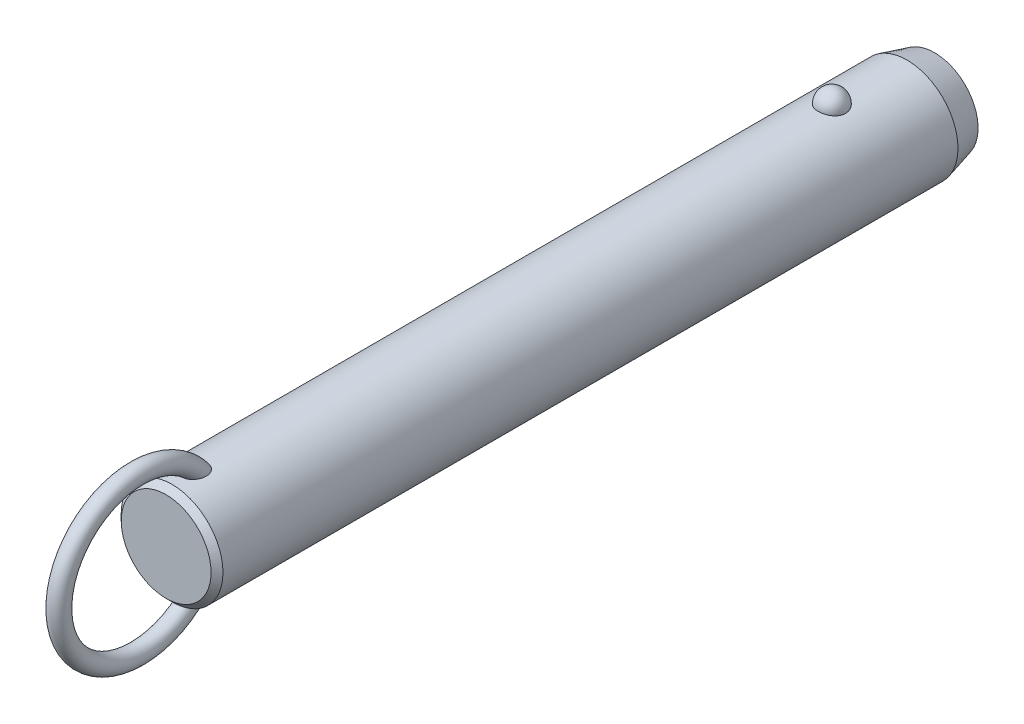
ISO-10303-21;
HEADER;
FILE_DESCRIPTION(('STEP AP214'),'2;1');
FILE_NAME('part.step','',(''),(''),'','','');
FILE_SCHEMA(('AUTOMOTIVE_DESIGN { 1 0 10303 214 1 1 1 1 }'));
ENDSEC;
DATA;
#1=APPLICATION_CONTEXT('core data for automotive mechanical design processes');
#2=APPLICATION_PROTOCOL_DEFINITION('international standard','automotive_design',2000,#1);
#3=PRODUCT_CONTEXT('',#1,'mechanical');
#4=PRODUCT('Part','Part','',(#3));
#5=PRODUCT_RELATED_PRODUCT_CATEGORY('part','',(#4));
#6=PRODUCT_DEFINITION_FORMATION('','',#4);
#7=PRODUCT_DEFINITION_CONTEXT('part definition',#1,'design');
#8=PRODUCT_DEFINITION('design','',#6,#7);
#9=PRODUCT_DEFINITION_SHAPE('','',#8);
#10=(LENGTH_UNIT() NAMED_UNIT(*) SI_UNIT(.MILLI.,.METRE.));
#11=(NAMED_UNIT(*) PLANE_ANGLE_UNIT() SI_UNIT($,.RADIAN.));
#12=(NAMED_UNIT(*) SI_UNIT($,.STERADIAN.) SOLID_ANGLE_UNIT());
#13=UNCERTAINTY_MEASURE_WITH_UNIT(LENGTH_MEASURE(1.E-05),#10,'distance_accuracy_value','');
#14=(GEOMETRIC_REPRESENTATION_CONTEXT(3) GLOBAL_UNCERTAINTY_ASSIGNED_CONTEXT((#13)) GLOBAL_UNIT_ASSIGNED_CONTEXT((#10,
#11,#12)) REPRESENTATION_CONTEXT('',''));
#15=CARTESIAN_POINT('',(0.,0.,0.));
#16=DIRECTION('',(0.,0.,1.));
#17=DIRECTION('',(1.,0.,0.));
#18=AXIS2_PLACEMENT_3D('',#15,#16,#17);
#19=CARTESIAN_POINT('',(0.,0.,129.5));
#20=DIRECTION('',(0.,0.,-1.));
#21=DIRECTION('',(-1.,0.,0.));
#22=AXIS2_PLACEMENT_3D('',#19,#20,#21);
#23=CYLINDRICAL_SURFACE('',#22,11.1);
#24=CARTESIAN_POINT('',(2.9724815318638,10.6945945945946,-3.));
#25=CARTESIAN_POINT('',(2.97247830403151,10.6945972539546,-2.83225059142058));
#26=CARTESIAN_POINT('',(2.95876598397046,10.6984356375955,-2.66445972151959));
#27=CARTESIAN_POINT('',(2.90424529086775,10.7133624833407,-2.33362381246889));
#28=CARTESIAN_POINT('',(2.8634252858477,10.7244540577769,-2.1705808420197));
#29=CARTESIAN_POINT('',(2.75573657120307,10.7526272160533,-1.85396767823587));
#30=CARTESIAN_POINT('',(2.68887937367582,10.7697061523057,-1.70039333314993));
#31=CARTESIAN_POINT('',(2.53079696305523,10.8079438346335,-1.40691598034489));
#32=CARTESIAN_POINT('',(2.43957264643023,10.8291024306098,-1.2670124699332));
#33=CARTESIAN_POINT('',(2.23458150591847,10.8732541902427,-1.00409565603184));
#34=CARTESIAN_POINT('',(2.12071295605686,10.8962553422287,-0.881162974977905));
#35=CARTESIAN_POINT('',(1.87365402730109,10.9414421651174,-0.656352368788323));
#36=CARTESIAN_POINT('',(1.74046358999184,10.9636278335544,-0.554474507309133));
#37=CARTESIAN_POINT('',(1.45872188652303,11.0046495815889,-0.374872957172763));
#38=CARTESIAN_POINT('',(1.31021276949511,11.0234944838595,-0.297085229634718));
#39=CARTESIAN_POINT('',(1.00170030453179,11.0557957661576,-0.167529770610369));
#40=CARTESIAN_POINT('',(0.841698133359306,11.0692526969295,-0.115759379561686));
#41=CARTESIAN_POINT('',(0.517607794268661,11.0890932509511,-0.0403925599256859));
#42=CARTESIAN_POINT('',(0.353633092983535,11.0955916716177,-0.0163383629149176));
#43=CARTESIAN_POINT('',(0.0238420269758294,11.1011989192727,0.0044517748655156));
#44=CARTESIAN_POINT('',(-0.141974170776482,11.1003084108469,0.00119017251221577));
#45=CARTESIAN_POINT('',(-0.468405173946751,11.0912990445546,-0.0323233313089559));
#46=CARTESIAN_POINT('',(-0.629059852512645,11.0832767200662,-0.0622147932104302));
#47=CARTESIAN_POINT('',(-0.942937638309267,11.0609962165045,-0.147645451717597));
#48=CARTESIAN_POINT('',(-1.09616062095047,11.0467379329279,-0.203185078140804));
#49=CARTESIAN_POINT('',(-1.39181061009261,11.0134071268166,-0.3387529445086));
#50=CARTESIAN_POINT('',(-1.53417383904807,10.9943086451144,-0.418913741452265));
#51=CARTESIAN_POINT('',(-1.80342160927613,10.9533667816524,-0.60144882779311));
#52=CARTESIAN_POINT('',(-1.9303046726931,10.9315231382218,-0.703825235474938));
#53=CARTESIAN_POINT('',(-2.16747598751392,10.887005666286,-0.930091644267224));
#54=CARTESIAN_POINT('',(-2.27742774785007,10.8643239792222,-1.05433291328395));
#55=CARTESIAN_POINT('',(-2.47517316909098,10.8209886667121,-1.31966633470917));
#56=CARTESIAN_POINT('',(-2.56296538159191,10.8003351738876,-1.46075958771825));
#57=CARTESIAN_POINT('',(-2.71500300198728,10.7631304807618,-1.75753646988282));
#58=CARTESIAN_POINT('',(-2.77898901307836,10.7466250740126,-1.91335887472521));
#59=CARTESIAN_POINT('',(-2.88046189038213,10.7198747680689,-2.2339152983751));
#60=CARTESIAN_POINT('',(-2.91794947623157,10.709629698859,-2.39864907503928));
#61=CARTESIAN_POINT('',(-2.96537819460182,10.6965949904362,-2.73165170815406));
#62=CARTESIAN_POINT('',(-2.97542891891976,10.693775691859,-2.89990378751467));
#63=CARTESIAN_POINT('',(-2.96804271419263,10.6958279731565,-3.235752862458));
#64=CARTESIAN_POINT('',(-2.95060646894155,10.7006993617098,-3.40334987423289));
#65=CARTESIAN_POINT('',(-2.88883358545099,10.71753912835,-3.73233906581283));
#66=CARTESIAN_POINT('',(-2.84462026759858,10.7294749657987,-3.89375610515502));
#67=CARTESIAN_POINT('',(-2.73050447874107,10.7590797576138,-4.20667949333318));
#68=CARTESIAN_POINT('',(-2.66060103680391,10.7767489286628,-4.35818546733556));
#69=CARTESIAN_POINT('',(-2.49642559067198,10.8159599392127,-4.6478542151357));
#70=CARTESIAN_POINT('',(-2.40203047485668,10.8375211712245,-4.78594458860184));
#71=CARTESIAN_POINT('',(-2.19143488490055,10.8820570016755,-5.0441038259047));
#72=CARTESIAN_POINT('',(-2.07523364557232,10.9050316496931,-5.16417205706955));
#73=CARTESIAN_POINT('',(-1.82361254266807,10.9499219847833,-5.38334833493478));
#74=CARTESIAN_POINT('',(-1.68812945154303,10.9718338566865,-5.48238464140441));
#75=CARTESIAN_POINT('',(-1.40191298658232,11.0120611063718,-5.65618873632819));
#76=CARTESIAN_POINT('',(-1.25118062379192,11.0303767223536,-5.73095813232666));
#77=CARTESIAN_POINT('',(-0.940570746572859,11.0611653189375,-5.85334725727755));
#78=CARTESIAN_POINT('',(-0.780821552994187,11.0737044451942,-5.90127578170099));
#79=CARTESIAN_POINT('',(-0.455204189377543,11.0918598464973,-5.96992976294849));
#80=CARTESIAN_POINT('',(-0.289336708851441,11.0974768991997,-5.99065827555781));
#81=CARTESIAN_POINT('',(0.0406846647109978,11.1011307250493,-6.00418773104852));
#82=CARTESIAN_POINT('',(0.204817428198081,11.099299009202,-5.99747318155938));
#83=CARTESIAN_POINT('',(0.5295530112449,11.088551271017,-5.9574031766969));
#84=CARTESIAN_POINT('',(0.69015594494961,11.0796354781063,-5.92404858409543));
#85=CARTESIAN_POINT('',(1.0027760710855,11.0557204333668,-5.83180084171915));
#86=CARTESIAN_POINT('',(1.15482001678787,11.0407414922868,-5.77299291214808));
#87=CARTESIAN_POINT('',(1.44678373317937,11.0062913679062,-5.63147366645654));
#88=CARTESIAN_POINT('',(1.58670279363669,10.9868199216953,-5.54876095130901));
#89=CARTESIAN_POINT('',(1.8527023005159,10.9451315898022,-5.36027644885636));
#90=CARTESIAN_POINT('',(1.97855158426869,10.9228788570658,-5.25418644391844));
#91=CARTESIAN_POINT('',(2.21080872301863,10.8782509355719,-5.02251354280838));
#92=CARTESIAN_POINT('',(2.31721312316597,10.8558757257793,-4.89692718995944));
#93=CARTESIAN_POINT('',(2.5094551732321,10.8130715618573,-4.62745408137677));
#94=CARTESIAN_POINT('',(2.59493284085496,10.7926798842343,-4.48330448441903));
#95=CARTESIAN_POINT('',(2.740862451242,10.7565495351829,-4.18236358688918));
#96=CARTESIAN_POINT('',(2.80132490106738,10.7408089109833,-4.02557762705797));
#97=CARTESIAN_POINT('',(2.88959070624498,10.7173718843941,-3.72475308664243));
#98=CARTESIAN_POINT('',(2.92062102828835,10.7088950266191,-3.58171216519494));
#99=CARTESIAN_POINT('',(2.96206765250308,10.6975052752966,-3.29245795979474));
#100=CARTESIAN_POINT('',(2.97248434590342,10.6945922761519,-3.14624473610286));
#101=CARTESIAN_POINT('',(2.9724815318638,10.6945945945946,-3.));
#102=B_SPLINE_CURVE_WITH_KNOTS('',3,(#24,#25,#26,#27,#28,#29,#30,#31,#32,#33,#34,#35,#36,#37,
#38,#39,#40,#41,#42,#43,#44,#45,#46,#47,#48,#49,#50,#51,#52,#53,#54,#55,#56,#57,#58,#59,#60,#61,
#62,#63,#64,#65,#66,#67,#68,#69,#70,#71,#72,#73,#74,#75,#76,#77,#78,#79,#80,#81,#82,#83,#84,#85,
#86,#87,#88,#89,#90,#91,#92,#93,#94,#95,#96,#97,#98,#99,#100,#101),.UNSPECIFIED.,.T.,.F.,(4,2,2,
2,2,2,2,2,2,2,2,2,2,2,2,2,2,2,2,2,2,2,2,2,2,2,2,2,2,2,2,2,2,2,2,2,2,2,4),(0.,0.502722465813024,
1.00566079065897,1.5083769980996,2.01107471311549,2.51608392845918,3.02109467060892,
3.52475118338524,4.02835620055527,4.523518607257,5.0186364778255,5.50715297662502,
5.9956776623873,6.48688002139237,6.97812923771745,7.47814366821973,7.9781907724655,
8.48353712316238,8.9888697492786,9.49218093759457,9.99547960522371,10.4964777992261,
10.997494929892,11.5010810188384,12.0046847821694,12.5099796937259,13.0152411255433,
13.5145635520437,14.0138298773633,14.5043200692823,14.9947943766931,15.4836390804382,
15.9725123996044,16.4685040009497,16.9645836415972,17.4686765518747,17.972557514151,
18.410841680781,18.849117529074),.UNSPECIFIED.);
#103=CARTESIAN_POINT('',(2.9724815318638,10.6945945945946,-3.));
#104=VERTEX_POINT('',#103);
#105=EDGE_CURVE('E41',#104,#104,#102,.T.);
#106=ORIENTED_EDGE('',*,*,#105,.T.);
#107=EDGE_LOOP('',(#106));
#108=FACE_BOUND('',#107,.T.);
#109=CARTESIAN_POINT('',(0.,0.,140.9));
#110=DIRECTION('',(0.,0.,1.));
#111=DIRECTION('',(1.,0.,0.));
#112=AXIS2_PLACEMENT_3D('',#109,#110,#111);
#113=CIRCLE('',#112,11.1);
#114=CARTESIAN_POINT('',(11.1,0.,140.9));
#115=VERTEX_POINT('',#114);
#116=EDGE_CURVE('E10',#115,#115,#113,.F.);
#117=ORIENTED_EDGE('',*,*,#116,.T.);
#118=EDGE_LOOP('',(#117));
#119=FACE_BOUND('',#118,.T.);
#120=CARTESIAN_POINT('',(-0.564520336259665,-11.0856356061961,133.157815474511));
#121=CARTESIAN_POINT('',(-0.667202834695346,-11.0804062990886,133.191283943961));
#122=CARTESIAN_POINT('',(-0.766875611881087,-11.0738877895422,133.233835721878));
#123=CARTESIAN_POINT('',(-0.95728412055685,-11.0590576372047,133.335419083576));
#124=CARTESIAN_POINT('',(-1.04801616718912,-11.0507452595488,133.39445742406));
#125=CARTESIAN_POINT('',(-1.21800952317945,-11.0333016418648,133.526529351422));
#126=CARTESIAN_POINT('',(-1.2973080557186,-11.0241732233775,133.599515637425));
#127=CARTESIAN_POINT('',(-1.44337665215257,-11.0060026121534,133.757037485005));
#128=CARTESIAN_POINT('',(-1.51014622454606,-10.9969604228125,133.841573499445));
#129=CARTESIAN_POINT('',(-1.63454620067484,-10.9791841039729,134.025521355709));
#130=CARTESIAN_POINT('',(-1.69127003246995,-10.9705107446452,134.125549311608));
#131=CARTESIAN_POINT('',(-1.7898078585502,-10.9548648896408,134.332790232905));
#132=CARTESIAN_POINT('',(-1.83161214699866,-10.9478935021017,134.440007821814));
#133=CARTESIAN_POINT('',(-1.91557028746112,-10.9335803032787,134.705408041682));
#134=CARTESIAN_POINT('',(-1.95040620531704,-10.9273269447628,134.865980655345));
#135=CARTESIAN_POINT('',(-1.99388326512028,-10.9194709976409,135.190697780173));
#136=CARTESIAN_POINT('',(-2.00248051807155,-10.9178762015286,135.354847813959));
#137=CARTESIAN_POINT('',(-1.99551615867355,-10.9191578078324,135.724650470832));
#138=CARTESIAN_POINT('',(-1.9732206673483,-10.9232807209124,135.930191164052));
#139=CARTESIAN_POINT('',(-1.9152976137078,-10.9335244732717,136.233595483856));
#140=CARTESIAN_POINT('',(-1.89184575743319,-10.9376266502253,136.334088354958));
#141=CARTESIAN_POINT('',(-1.83700674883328,-10.9469720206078,136.532855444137));
#142=CARTESIAN_POINT('',(-1.80562070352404,-10.9522150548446,136.631129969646));
#143=CARTESIAN_POINT('',(-1.73463055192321,-10.9636837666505,136.825914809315));
#144=CARTESIAN_POINT('',(-1.69493416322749,-10.9699202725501,136.922390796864));
#145=CARTESIAN_POINT('',(-1.60745141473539,-10.9830806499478,137.111626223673));
#146=CARTESIAN_POINT('',(-1.55966150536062,-10.9900048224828,137.204384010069));
#147=CARTESIAN_POINT('',(-1.45591812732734,-11.0042280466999,137.384690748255));
#148=CARTESIAN_POINT('',(-1.40000013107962,-11.0115253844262,137.472260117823));
#149=CARTESIAN_POINT('',(-1.27937470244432,-11.0261911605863,137.641029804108));
#150=CARTESIAN_POINT('',(-1.21467835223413,-11.0335594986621,137.72223795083));
#151=CARTESIAN_POINT('',(-1.08218150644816,-11.0473027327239,137.869001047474));
#152=CARTESIAN_POINT('',(-1.01522633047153,-11.0537063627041,137.935309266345));
#153=CARTESIAN_POINT('',(-0.872952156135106,-11.065850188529,138.058378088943));
#154=CARTESIAN_POINT('',(-0.797642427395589,-11.0715911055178,138.115149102));
#155=CARTESIAN_POINT('',(-0.651396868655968,-11.081071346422,138.207515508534));
#156=CARTESIAN_POINT('',(-0.581712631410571,-11.0849841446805,138.245049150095));
#157=CARTESIAN_POINT('',(-0.43706608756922,-11.0916271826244,138.308259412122));
#158=CARTESIAN_POINT('',(-0.362109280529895,-11.0943586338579,138.333948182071));
#159=CARTESIAN_POINT('',(-0.207828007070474,-11.0983242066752,138.371117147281));
#160=CARTESIAN_POINT('',(-0.12846771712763,-11.0995432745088,138.382454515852));
#161=CARTESIAN_POINT('',(0.0309101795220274,-11.1002423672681,138.388965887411));
#162=CARTESIAN_POINT('',(0.110927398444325,-11.0997233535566,138.384148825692));
#163=CARTESIAN_POINT('',(0.25640659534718,-11.097240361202,138.360959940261));
#164=CARTESIAN_POINT('',(0.322235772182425,-11.0955074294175,138.344754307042));
#165=CARTESIAN_POINT('',(0.450635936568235,-11.0910350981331,138.302600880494));
#166=CARTESIAN_POINT('',(0.513205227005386,-11.0882951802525,138.276648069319));
#167=CARTESIAN_POINT('',(0.662626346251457,-11.0805620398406,138.202607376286));
#168=CARTESIAN_POINT('',(0.747127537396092,-11.0751144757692,138.149845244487));
#169=CARTESIAN_POINT('',(0.906756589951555,-11.0631932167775,138.031720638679));
#170=CARTESIAN_POINT('',(0.981859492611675,-11.0567168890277,137.966325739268));
#171=CARTESIAN_POINT('',(1.10712207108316,-11.0447856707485,137.84226337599));
#172=CARTESIAN_POINT('',(1.15909566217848,-11.0394280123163,137.785383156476));
#173=CARTESIAN_POINT('',(1.25791923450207,-11.0286040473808,137.667327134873));
#174=CARTESIAN_POINT('',(1.30476642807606,-11.0231376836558,137.606149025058));
#175=CARTESIAN_POINT('',(1.43818612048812,-11.0068027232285,137.417305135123));
#176=CARTESIAN_POINT('',(1.51751767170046,-10.9960104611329,137.284453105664));
#177=CARTESIAN_POINT('',(1.63597546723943,-10.9788847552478,137.053137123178));
#178=CARTESIAN_POINT('',(1.67988876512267,-10.9722190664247,136.957053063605));
#179=CARTESIAN_POINT('',(1.75953241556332,-10.9597298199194,136.761431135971));
#180=CARTESIAN_POINT('',(1.7952596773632,-10.9539065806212,136.661891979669));
#181=CARTESIAN_POINT('',(1.85844731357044,-10.9433632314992,136.46021118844));
#182=CARTESIAN_POINT('',(1.88591073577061,-10.9386427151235,136.35807052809));
#183=CARTESIAN_POINT('',(1.93234324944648,-10.9305350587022,136.151819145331));
#184=CARTESIAN_POINT('',(1.95131065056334,-10.9271481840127,136.047708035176));
#185=CARTESIAN_POINT('',(1.9904020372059,-10.9201183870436,135.765458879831));
#186=CARTESIAN_POINT('',(2.00221217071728,-10.9179256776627,135.586037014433));
#187=CARTESIAN_POINT('',(1.99711676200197,-10.9188636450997,135.227713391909));
#188=CARTESIAN_POINT('',(1.98026150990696,-10.9219849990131,135.048811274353));
#189=CARTESIAN_POINT('',(1.92151657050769,-10.9324473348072,134.73645144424));
#190=CARTESIAN_POINT('',(1.88605081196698,-10.9386915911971,134.601759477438));
#191=CARTESIAN_POINT('',(1.79393020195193,-10.9541780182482,134.339966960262));
#192=CARTESIAN_POINT('',(1.73729868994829,-10.9634168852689,134.212858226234));
#193=CARTESIAN_POINT('',(1.61237037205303,-10.9824218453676,133.989418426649));
#194=CARTESIAN_POINT('',(1.54715374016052,-10.9918945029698,133.891345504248));
#195=CARTESIAN_POINT('',(1.40127026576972,-11.0114415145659,133.707434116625));
#196=CARTESIAN_POINT('',(1.32060742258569,-11.0215157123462,133.621592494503));
#197=CARTESIAN_POINT('',(1.1447478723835,-11.041168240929,133.465163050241));
#198=CARTESIAN_POINT('',(1.04947805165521,-11.0507437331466,133.394656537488));
#199=CARTESIAN_POINT('',(0.847278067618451,-11.0680789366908,133.272640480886));
#200=CARTESIAN_POINT('',(0.74035174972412,-11.0758392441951,133.221124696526));
#201=CARTESIAN_POINT('',(0.529289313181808,-11.0878275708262,133.143485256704));
#202=CARTESIAN_POINT('',(0.425895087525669,-11.0923259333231,133.115377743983));
#203=CARTESIAN_POINT('',(0.215723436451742,-11.0984001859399,133.077703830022));
#204=CARTESIAN_POINT('',(0.108947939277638,-11.0999777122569,133.068127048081));
#205=CARTESIAN_POINT('',(-0.0938962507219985,-11.1000196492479,133.067877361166));
#206=CARTESIAN_POINT('',(-0.189967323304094,-11.0987797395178,133.075408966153));
#207=CARTESIAN_POINT('',(-0.379657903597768,-11.0939111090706,133.105507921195));
#208=CARTESIAN_POINT('',(-0.47327735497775,-11.0902823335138,133.128075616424));
#209=CARTESIAN_POINT('',(-0.564520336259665,-11.0856356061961,133.157815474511));
#210=B_SPLINE_CURVE_WITH_KNOTS('',3,(#120,#121,#122,#123,#124,#125,#126,#127,#128,#129,#130,
#131,#132,#133,#134,#135,#136,#137,#138,#139,#140,#141,#142,#143,#144,#145,#146,#147,#148,#149,
#150,#151,#152,#153,#154,#155,#156,#157,#158,#159,#160,#161,#162,#163,#164,#165,#166,#167,#168,
#169,#170,#171,#172,#173,#174,#175,#176,#177,#178,#179,#180,#181,#182,#183,#184,#185,#186,#187,
#188,#189,#190,#191,#192,#193,#194,#195,#196,#197,#198,#199,#200,#201,#202,#203,#204,#205,#206,
#207,#208,#209),.UNSPECIFIED.,.T.,.F.,(4,2,2,2,2,2,2,2,2,2,2,2,2,2,2,2,2,2,2,2,2,2,2,2,2,2,2,2,
2,2,2,2,2,2,2,2,2,2,2,2,2,2,2,2,4),(0.,0.323999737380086,0.64813245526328,0.971184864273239,
1.29424994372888,1.63886237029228,1.98369857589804,2.47426059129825,2.96564271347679,
3.58257396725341,3.89215258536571,4.20168803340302,4.51486273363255,4.82817514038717,
5.14015911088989,5.45175282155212,5.73442856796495,6.01679375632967,6.2536458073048,
6.49025437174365,6.72919963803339,6.96801276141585,7.17061258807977,7.37331685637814,
7.67094989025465,7.96935728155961,8.20075067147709,8.4322692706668,8.89581623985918,
9.21306533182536,9.53043400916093,9.84768549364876,10.1650000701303,10.7022930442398,
11.2386443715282,11.655339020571,12.071575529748,12.4245637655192,12.7774607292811,
13.1321855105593,13.4867936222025,13.8068771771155,14.1267813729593,14.4146787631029,
14.7025827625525),.UNSPECIFIED.);
#211=CARTESIAN_POINT('',(-0.564520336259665,-11.0856356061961,133.157815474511));
#212=VERTEX_POINT('',#211);
#213=EDGE_CURVE('E59',#212,#212,#210,.T.);
#214=ORIENTED_EDGE('',*,*,#213,.T.);
#215=EDGE_LOOP('',(#214));
#216=FACE_BOUND('',#215,.T.);
#217=CARTESIAN_POINT('',(-0.564520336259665,11.0856356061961,133.157815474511));
#218=CARTESIAN_POINT('',(-0.468542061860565,11.0905203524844,133.126545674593));
#219=CARTESIAN_POINT('',(-0.369793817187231,11.0942886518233,133.103157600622));
#220=CARTESIAN_POINT('',(-0.169555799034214,11.0991586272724,133.073085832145));
#221=CARTESIAN_POINT('',(-0.0680604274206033,11.1002543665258,133.06643932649));
#222=CARTESIAN_POINT('',(0.134549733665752,11.099646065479,133.070157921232));
#223=CARTESIAN_POINT('',(0.235664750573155,11.0979441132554,133.08051033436));
#224=CARTESIAN_POINT('',(0.434632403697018,11.0919342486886,133.117831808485));
#225=CARTESIAN_POINT('',(0.532486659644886,11.0876276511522,133.144792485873));
#226=CARTESIAN_POINT('',(0.722445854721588,11.0768742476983,133.2144096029));
#227=CARTESIAN_POINT('',(0.814543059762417,11.0704246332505,133.257086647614));
#228=CARTESIAN_POINT('',(0.990565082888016,11.0560659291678,133.356648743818));
#229=CARTESIAN_POINT('',(1.07448844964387,11.048156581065,133.413536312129));
#230=CARTESIAN_POINT('',(1.23562672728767,11.0313221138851,133.542210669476));
#231=CARTESIAN_POINT('',(1.3124268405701,11.0223686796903,133.614511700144));
#232=CARTESIAN_POINT('',(1.45398030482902,11.0045918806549,133.770042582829));
#233=CARTESIAN_POINT('',(1.51873073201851,10.9957685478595,133.853275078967));
#234=CARTESIAN_POINT('',(1.64107232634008,10.9782087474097,134.036384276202));
#235=CARTESIAN_POINT('',(1.6974317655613,10.9695572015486,134.137089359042));
#236=CARTESIAN_POINT('',(1.79515063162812,10.9539887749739,134.345626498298));
#237=CARTESIAN_POINT('',(1.83649966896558,10.9470730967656,134.45346343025));
#238=CARTESIAN_POINT('',(1.91931148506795,10.9329211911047,134.720399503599));
#239=CARTESIAN_POINT('',(1.95340104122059,10.9267904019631,134.881861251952));
#240=CARTESIAN_POINT('',(1.99526195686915,10.9192174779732,135.20821631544));
#241=CARTESIAN_POINT('',(2.00298989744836,10.9177830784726,135.37311484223));
#242=CARTESIAN_POINT('',(1.99396251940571,10.9194420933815,135.744100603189));
#243=CARTESIAN_POINT('',(1.97050829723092,10.923774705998,135.95003871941));
#244=CARTESIAN_POINT('',(1.91079643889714,10.9343131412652,136.253901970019));
#245=CARTESIAN_POINT('',(1.88673702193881,10.9385106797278,136.354529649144));
#246=CARTESIAN_POINT('',(1.83065508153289,10.9480376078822,136.553510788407));
#247=CARTESIAN_POINT('',(1.79863369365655,10.9533668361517,136.651864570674));
#248=CARTESIAN_POINT('',(1.72633365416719,10.9649954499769,136.846720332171));
#249=CARTESIAN_POINT('',(1.68596409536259,10.9713053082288,136.94318790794));
#250=CARTESIAN_POINT('',(1.59707998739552,10.9845964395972,137.132323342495));
#251=CARTESIAN_POINT('',(1.54856169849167,10.9915780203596,137.224989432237));
#252=CARTESIAN_POINT('',(1.44330168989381,11.0058935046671,137.404975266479));
#253=CARTESIAN_POINT('',(1.3865974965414,11.0132257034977,137.492316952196));
#254=CARTESIAN_POINT('',(1.26431158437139,11.0279330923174,137.660456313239));
#255=CARTESIAN_POINT('',(1.19874160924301,11.0353082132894,137.741262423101));
#256=CARTESIAN_POINT('',(1.06542088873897,11.048931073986,137.885985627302));
#257=CARTESIAN_POINT('',(0.998640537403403,11.0552153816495,137.950784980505));
#258=CARTESIAN_POINT('',(0.856896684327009,11.0671032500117,138.070846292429));
#259=CARTESIAN_POINT('',(0.781942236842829,11.0727075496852,138.126118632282));
#260=CARTESIAN_POINT('',(0.636276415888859,11.081949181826,138.215972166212));
#261=CARTESIAN_POINT('',(0.566755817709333,11.0857572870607,138.252441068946));
#262=CARTESIAN_POINT('',(0.422602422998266,11.0921860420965,138.313533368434));
#263=CARTESIAN_POINT('',(0.347974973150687,11.0948079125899,138.338168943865));
#264=CARTESIAN_POINT('',(0.194593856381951,11.0985608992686,138.373323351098));
#265=CARTESIAN_POINT('',(0.115807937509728,11.0996777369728,138.383706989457));
#266=CARTESIAN_POINT('',(-0.042249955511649,11.1002003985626,138.388574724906));
#267=CARTESIAN_POINT('',(-0.121521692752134,11.09960699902,138.383066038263));
#268=CARTESIAN_POINT('',(-0.26604624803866,11.0970123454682,138.358827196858));
#269=CARTESIAN_POINT('',(-0.331661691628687,11.0952283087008,138.342135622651));
#270=CARTESIAN_POINT('',(-0.459588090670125,11.0906663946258,138.299111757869));
#271=CARTESIAN_POINT('',(-0.521897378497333,11.0878880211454,138.272774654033));
#272=CARTESIAN_POINT('',(-0.671446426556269,11.0800342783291,138.197513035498));
#273=CARTESIAN_POINT('',(-0.756250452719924,11.0744969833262,138.143818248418));
#274=CARTESIAN_POINT('',(-0.916349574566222,11.0624045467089,138.023802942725));
#275=CARTESIAN_POINT('',(-0.991618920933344,11.0558467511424,137.957449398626));
#276=CARTESIAN_POINT('',(-1.11713140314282,11.0437783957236,137.831633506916));
#277=CARTESIAN_POINT('',(-1.16920539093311,11.0383619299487,137.773952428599));
#278=CARTESIAN_POINT('',(-1.2681747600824,11.02743010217,137.654280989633));
#279=CARTESIAN_POINT('',(-1.31506731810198,11.0219146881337,137.592288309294));
#280=CARTESIAN_POINT('',(-1.40399813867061,11.0109399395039,137.464784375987));
#281=CARTESIAN_POINT('',(-1.44602864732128,11.0054807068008,137.399267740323));
#282=CARTESIAN_POINT('',(-1.52538779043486,10.9947621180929,137.265422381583));
#283=CARTESIAN_POINT('',(-1.56271516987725,10.9895028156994,137.197092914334));
#284=CARTESIAN_POINT('',(-1.64537943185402,10.9774790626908,137.033210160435));
#285=CARTESIAN_POINT('',(-1.68879497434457,10.9708503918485,136.9366735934));
#286=CARTESIAN_POINT('',(-1.76740738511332,10.9584602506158,136.740236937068));
#287=CARTESIAN_POINT('',(-1.80260120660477,10.95269910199,136.64033561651));
#288=CARTESIAN_POINT('',(-1.86468657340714,10.9423003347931,136.437966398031));
#289=CARTESIAN_POINT('',(-1.8915816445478,10.9376622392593,136.335499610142));
#290=CARTESIAN_POINT('',(-1.93682458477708,10.9297405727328,136.128642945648));
#291=CARTESIAN_POINT('',(-1.95517082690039,10.9264572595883,136.024252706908));
#292=CARTESIAN_POINT('',(-1.99232562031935,10.9197647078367,135.74262876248));
#293=CARTESIAN_POINT('',(-2.00294603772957,10.9177914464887,135.564185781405));
#294=CARTESIAN_POINT('',(-1.99566675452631,10.9191290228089,135.207996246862));
#295=CARTESIAN_POINT('',(-1.97781651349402,10.9224306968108,135.03024902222));
#296=CARTESIAN_POINT('',(-1.91747214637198,10.9331592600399,134.719792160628));
#297=CARTESIAN_POINT('',(-1.88131022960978,10.9395108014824,134.585825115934));
#298=CARTESIAN_POINT('',(-1.78790380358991,10.9551659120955,134.32559757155));
#299=CARTESIAN_POINT('',(-1.73068309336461,10.9644661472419,134.199328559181));
#300=CARTESIAN_POINT('',(-1.60475573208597,10.9835398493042,133.97741565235));
#301=CARTESIAN_POINT('',(-1.53908879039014,10.9930297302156,133.880026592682));
#302=CARTESIAN_POINT('',(-1.39238608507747,11.0125708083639,133.697525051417));
#303=CARTESIAN_POINT('',(-1.31135150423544,11.0226219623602,133.612411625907));
#304=CARTESIAN_POINT('',(-1.14382035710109,11.0411991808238,133.46529943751));
#305=CARTESIAN_POINT('',(-1.0585850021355,11.0497792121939,133.40186930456));
#306=CARTESIAN_POINT('',(-0.878723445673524,11.0655285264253,133.290250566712));
#307=CARTESIAN_POINT('',(-0.784123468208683,11.0727015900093,133.242020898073));
#308=CARTESIAN_POINT('',(-0.646163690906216,11.0812501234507,133.186023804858));
#309=CARTESIAN_POINT('',(-0.605595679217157,11.0835451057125,133.171197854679));
#310=CARTESIAN_POINT('',(-0.564520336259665,11.0856356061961,133.157815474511));
#311=B_SPLINE_CURVE_WITH_KNOTS('',3,(#217,#218,#219,#220,#221,#222,#223,#224,#225,#226,#227,
#228,#229,#230,#231,#232,#233,#234,#235,#236,#237,#238,#239,#240,#241,#242,#243,#244,#245,#246,
#247,#248,#249,#250,#251,#252,#253,#254,#255,#256,#257,#258,#259,#260,#261,#262,#263,#264,#265,
#266,#267,#268,#269,#270,#271,#272,#273,#274,#275,#276,#277,#278,#279,#280,#281,#282,#283,#284,
#285,#286,#287,#288,#289,#290,#291,#292,#293,#294,#295,#296,#297,#298,#299,#300,#301,#302,#303,
#304,#305,#306,#307,#308,#309,#310),.UNSPECIFIED.,.T.,.F.,(4,2,2,2,2,2,2,2,2,2,2,2,2,2,2,2,2,2,
2,2,2,2,2,2,2,2,2,2,2,2,2,2,2,2,2,2,2,2,2,2,2,2,2,2,2,2,4),(0.,0.303061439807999,
0.606795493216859,0.910302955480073,1.21365733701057,1.51741085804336,1.82121821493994,
2.13745205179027,2.45376252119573,2.79958678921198,3.14564996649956,3.63832391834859,
4.13180893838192,4.75031912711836,5.06071926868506,5.37107516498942,5.6850077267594,
5.99908475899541,6.31176519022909,6.62403542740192,6.90315673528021,7.18197194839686,
7.41687778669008,7.65154134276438,7.88841587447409,8.12518286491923,8.32752842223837,
8.52997509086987,8.82986421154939,9.13054668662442,9.36393502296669,9.5974499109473,
9.83133221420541,10.0652767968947,10.383032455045,10.7009056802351,11.0186436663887,
11.3364420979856,11.8705925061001,12.4038159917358,12.8189662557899,13.2336487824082,
13.5857049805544,13.9377340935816,14.2561354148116,14.5736690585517,14.7033687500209),.UNSPECIFIED.);
#312=CARTESIAN_POINT('',(-0.564520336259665,11.0856356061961,133.157815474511));
#313=VERTEX_POINT('',#312);
#314=EDGE_CURVE('E67',#313,#313,#311,.T.);
#315=ORIENTED_EDGE('',*,*,#314,.T.);
#316=EDGE_LOOP('',(#315));
#317=FACE_BOUND('',#316,.T.);
#318=CARTESIAN_POINT('',(0.,0.,-19.3999999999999));
#319=DIRECTION('',(0.,0.,-1.));
#320=DIRECTION('',(-1.,0.,0.));
#321=AXIS2_PLACEMENT_3D('',#318,#319,#320);
#322=CIRCLE('',#321,11.1);
#323=CARTESIAN_POINT('',(-11.1,0.,-19.3999999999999));
#324=VERTEX_POINT('',#323);
#325=EDGE_CURVE('E56',#324,#324,#322,.F.);
#326=ORIENTED_EDGE('',*,*,#325,.T.);
#327=EDGE_LOOP('',(#326));
#328=FACE_BOUND('',#327,.T.);
#329=ADVANCED_FACE('F37',(#108,#119,#216,#317,#328),#23,.T.);
#330=CARTESIAN_POINT('',(0.,0.,-25.4));
#331=DIRECTION('',(0.,0.,-1.));
#332=DIRECTION('',(-1.,0.,0.));
#333=AXIS2_PLACEMENT_3D('',#330,#331,#332);
#334=PLANE('',#333);
#335=CARTESIAN_POINT('',(0.,0.,-25.4));
#336=DIRECTION('',(0.,0.,-1.));
#337=DIRECTION('',(-1.,0.,0.));
#338=AXIS2_PLACEMENT_3D('',#335,#336,#337);
#339=CIRCLE('',#338,9.49230484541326);
#340=CARTESIAN_POINT('',(-9.49230484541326,0.,-25.4));
#341=VERTEX_POINT('',#340);
#342=EDGE_CURVE('E66',#341,#341,#339,.T.);
#343=ORIENTED_EDGE('',*,*,#342,.T.);
#344=EDGE_LOOP('',(#343));
#345=FACE_BOUND('',#344,.T.);
#346=ADVANCED_FACE('F85',(#345),#334,.T.);
#347=CARTESIAN_POINT('',(0.,0.,-25.4));
#348=DIRECTION('',(0.,0.,1.));
#349=DIRECTION('',(1.,0.,0.));
#350=AXIS2_PLACEMENT_3D('',#347,#348,#349);
#351=CONICAL_SURFACE('',#350,9.49230484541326,0.261799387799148);
#352=ORIENTED_EDGE('',*,*,#325,.F.);
#353=EDGE_LOOP('',(#352));
#354=FACE_BOUND('',#353,.T.);
#355=ORIENTED_EDGE('',*,*,#342,.F.);
#356=EDGE_LOOP('',(#355));
#357=FACE_BOUND('',#356,.T.);
#358=ADVANCED_FACE('F83',(#354,#357),#351,.T.);
#359=CARTESIAN_POINT('',(0.,0.,142.2));
#360=DIRECTION('',(0.,0.,1.));
#361=DIRECTION('',(1.,0.,0.));
#362=AXIS2_PLACEMENT_3D('',#359,#360,#361);
#363=PLANE('',#362);
#364=CARTESIAN_POINT('',(0.,0.,142.2));
#365=DIRECTION('',(0.,0.,1.));
#366=DIRECTION('',(1.,0.,0.));
#367=AXIS2_PLACEMENT_3D('',#364,#365,#366);
#368=CIRCLE('',#367,9.80000000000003);
#369=CARTESIAN_POINT('',(9.80000000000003,0.,142.2));
#370=VERTEX_POINT('',#369);
#371=EDGE_CURVE('E50',#370,#370,#368,.T.);
#372=ORIENTED_EDGE('',*,*,#371,.T.);
#373=EDGE_LOOP('',(#372));
#374=FACE_BOUND('',#373,.T.);
#375=ADVANCED_FACE('F77',(#374),#363,.T.);
#376=CARTESIAN_POINT('',(0.,0.,148.55));
#377=DIRECTION('',(1.,0.,0.));
#378=DIRECTION('',(0.,0.,-1.));
#379=AXIS2_PLACEMENT_3D('',#376,#377,#378);
#380=TOROIDAL_SURFACE('',#379,17.05,2.);
#381=ORIENTED_EDGE('',*,*,#314,.F.);
#382=EDGE_LOOP('',(#381));
#383=FACE_BOUND('',#382,.T.);
#384=ORIENTED_EDGE('',*,*,#213,.F.);
#385=EDGE_LOOP('',(#384));
#386=FACE_BOUND('',#385,.T.);
#387=ADVANCED_FACE('F73',(#383,#386),#380,.T.);
#388=CARTESIAN_POINT('',(0.,0.,142.2));
#389=DIRECTION('',(0.,0.,-1.));
#390=DIRECTION('',(-1.,0.,0.));
#391=AXIS2_PLACEMENT_3D('',#388,#389,#390);
#392=CONICAL_SURFACE('',#391,9.80000000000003,0.785398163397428);
#393=ORIENTED_EDGE('',*,*,#116,.F.);
#394=EDGE_LOOP('',(#393));
#395=FACE_BOUND('',#394,.T.);
#396=ORIENTED_EDGE('',*,*,#371,.F.);
#397=EDGE_LOOP('',(#396));
#398=FACE_BOUND('',#397,.T.);
#399=ADVANCED_FACE('F39',(#395,#398),#392,.T.);
#400=CARTESIAN_POINT('',(0.,11.1,-3.));
#401=DIRECTION('',(0.,1.,0.));
#402=DIRECTION('',(0.,0.,-1.));
#403=AXIS2_PLACEMENT_3D('',#400,#401,#402);
#404=SPHERICAL_SURFACE('',#403,3.);
#405=ORIENTED_EDGE('',*,*,#105,.F.);
#406=EDGE_LOOP('',(#405));
#407=FACE_BOUND('',#406,.T.);
#408=ADVANCED_FACE('F79',(#407),#404,.T.);
#409=CLOSED_SHELL('',(#329,#346,#358,#375,#387,#399,#408));
#410=MANIFOLD_SOLID_BREP('B2',#409);
#411=ADVANCED_BREP_SHAPE_REPRESENTATION('',(#18,#410),#14);
#412=SHAPE_DEFINITION_REPRESENTATION(#9,#411);
ENDSEC;
END-ISO-10303-21;
